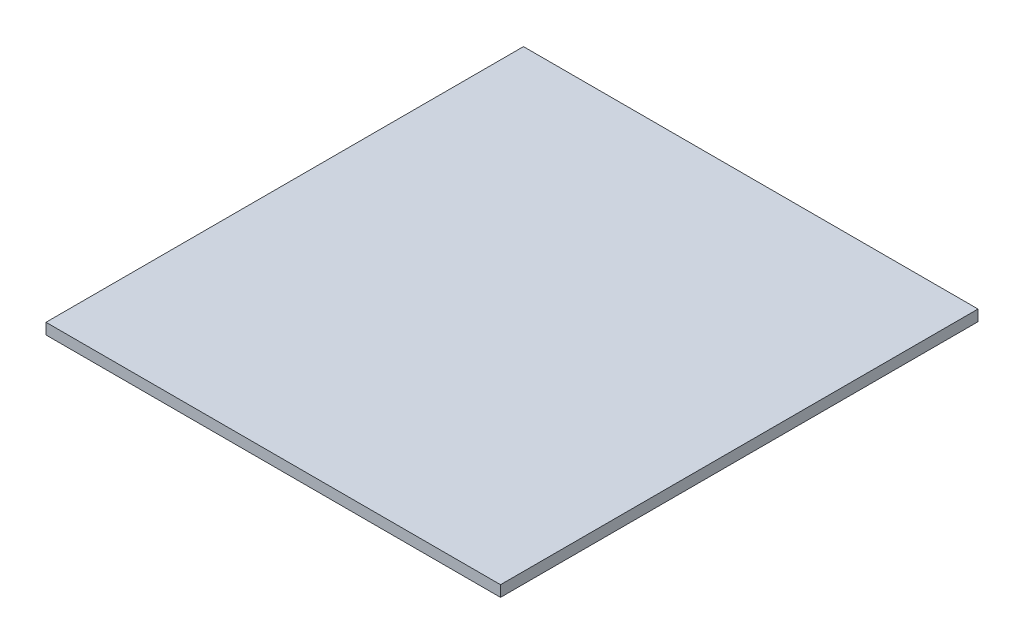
ISO-10303-21;
HEADER;
FILE_DESCRIPTION(('STEP AP214'),'2;1');
FILE_NAME('part.step','',(''),(''),'','','');
FILE_SCHEMA(('AUTOMOTIVE_DESIGN { 1 0 10303 214 1 1 1 1 }'));
ENDSEC;
DATA;
#1=APPLICATION_CONTEXT('core data for automotive mechanical design processes');
#2=APPLICATION_PROTOCOL_DEFINITION('international standard','automotive_design',2000,#1);
#3=PRODUCT_CONTEXT('',#1,'mechanical');
#4=PRODUCT('Part','Part','',(#3));
#5=PRODUCT_RELATED_PRODUCT_CATEGORY('part','',(#4));
#6=PRODUCT_DEFINITION_FORMATION('','',#4);
#7=PRODUCT_DEFINITION_CONTEXT('part definition',#1,'design');
#8=PRODUCT_DEFINITION('design','',#6,#7);
#9=PRODUCT_DEFINITION_SHAPE('','',#8);
#10=(LENGTH_UNIT() NAMED_UNIT(*) SI_UNIT(.MILLI.,.METRE.));
#11=(NAMED_UNIT(*) PLANE_ANGLE_UNIT() SI_UNIT($,.RADIAN.));
#12=(NAMED_UNIT(*) SI_UNIT($,.STERADIAN.) SOLID_ANGLE_UNIT());
#13=UNCERTAINTY_MEASURE_WITH_UNIT(LENGTH_MEASURE(1.E-05),#10,'distance_accuracy_value','');
#14=(GEOMETRIC_REPRESENTATION_CONTEXT(3) GLOBAL_UNCERTAINTY_ASSIGNED_CONTEXT((#13)) GLOBAL_UNIT_ASSIGNED_CONTEXT((#10,
#11,#12)) REPRESENTATION_CONTEXT('',''));
#15=CARTESIAN_POINT('',(0.,0.,0.));
#16=DIRECTION('',(0.,0.,1.));
#17=DIRECTION('',(1.,0.,0.));
#18=AXIS2_PLACEMENT_3D('',#15,#16,#17);
#19=CARTESIAN_POINT('',(247.5,12.,260.));
#20=DIRECTION('',(-1.,0.,0.));
#21=DIRECTION('',(0.,0.,1.));
#22=AXIS2_PLACEMENT_3D('',#19,#20,#21);
#23=PLANE('',#22);
#24=DIRECTION('',(0.,0.,-1.));
#25=VECTOR('',#24,1.);
#26=CARTESIAN_POINT('',(247.5,0.,260.));
#27=LINE('',#26,#25);
#28=CARTESIAN_POINT('',(247.5,0.,260.));
#29=VERTEX_POINT('',#28);
#30=CARTESIAN_POINT('',(247.5,0.,-260.));
#31=VERTEX_POINT('',#30);
#32=EDGE_CURVE('E98',#29,#31,#27,.T.);
#33=ORIENTED_EDGE('',*,*,#32,.T.);
#34=DIRECTION('',(0.,-1.,0.));
#35=VECTOR('',#34,1.);
#36=CARTESIAN_POINT('',(247.5,12.,-260.));
#37=LINE('',#36,#35);
#38=CARTESIAN_POINT('',(247.5,12.,-260.));
#39=VERTEX_POINT('',#38);
#40=EDGE_CURVE('E11',#39,#31,#37,.T.);
#41=ORIENTED_EDGE('',*,*,#40,.F.);
#42=DIRECTION('',(0.,0.,-1.));
#43=VECTOR('',#42,1.);
#44=CARTESIAN_POINT('',(247.5,12.,260.));
#45=LINE('',#44,#43);
#46=CARTESIAN_POINT('',(247.5,12.,260.));
#47=VERTEX_POINT('',#46);
#48=EDGE_CURVE('E86',#47,#39,#45,.T.);
#49=ORIENTED_EDGE('',*,*,#48,.F.);
#50=DIRECTION('',(0.,-1.,0.));
#51=VECTOR('',#50,1.);
#52=CARTESIAN_POINT('',(247.5,12.,260.));
#53=LINE('',#52,#51);
#54=EDGE_CURVE('E94',#47,#29,#53,.T.);
#55=ORIENTED_EDGE('',*,*,#54,.T.);
#56=EDGE_LOOP('',(#33,#41,#49,#55));
#57=FACE_BOUND('',#56,.T.);
#58=ADVANCED_FACE('F35',(#57),#23,.F.);
#59=CARTESIAN_POINT('',(-247.5,12.,-260.));
#60=DIRECTION('',(0.,0.,1.));
#61=DIRECTION('',(1.,0.,0.));
#62=AXIS2_PLACEMENT_3D('',#59,#60,#61);
#63=PLANE('',#62);
#64=DIRECTION('',(-1.,0.,0.));
#65=VECTOR('',#64,1.);
#66=CARTESIAN_POINT('',(-247.5,0.,-260.));
#67=LINE('',#66,#65);
#68=CARTESIAN_POINT('',(-247.5,0.,-260.));
#69=VERTEX_POINT('',#68);
#70=EDGE_CURVE('E90',#31,#69,#67,.T.);
#71=ORIENTED_EDGE('',*,*,#70,.T.);
#72=DIRECTION('',(0.,-1.,0.));
#73=VECTOR('',#72,1.);
#74=CARTESIAN_POINT('',(-247.5,12.,-260.));
#75=LINE('',#74,#73);
#76=CARTESIAN_POINT('',(-247.5,12.,-260.));
#77=VERTEX_POINT('',#76);
#78=EDGE_CURVE('E43',#77,#69,#75,.T.);
#79=ORIENTED_EDGE('',*,*,#78,.F.);
#80=DIRECTION('',(-1.,0.,0.));
#81=VECTOR('',#80,1.);
#82=CARTESIAN_POINT('',(-247.5,12.,-260.));
#83=LINE('',#82,#81);
#84=EDGE_CURVE('E81',#39,#77,#83,.T.);
#85=ORIENTED_EDGE('',*,*,#84,.F.);
#86=ORIENTED_EDGE('',*,*,#40,.T.);
#87=EDGE_LOOP('',(#71,#79,#85,#86));
#88=FACE_BOUND('',#87,.T.);
#89=ADVANCED_FACE('F89',(#88),#63,.F.);
#90=CARTESIAN_POINT('',(-247.5,12.,260.));
#91=DIRECTION('',(1.,0.,0.));
#92=DIRECTION('',(0.,0.,-1.));
#93=AXIS2_PLACEMENT_3D('',#90,#91,#92);
#94=PLANE('',#93);
#95=DIRECTION('',(0.,0.,1.));
#96=VECTOR('',#95,1.);
#97=CARTESIAN_POINT('',(-247.5,0.,260.));
#98=LINE('',#97,#96);
#99=CARTESIAN_POINT('',(-247.5,0.,260.));
#100=VERTEX_POINT('',#99);
#101=EDGE_CURVE('E68',#69,#100,#98,.T.);
#102=ORIENTED_EDGE('',*,*,#101,.T.);
#103=DIRECTION('',(0.,-1.,0.));
#104=VECTOR('',#103,1.);
#105=CARTESIAN_POINT('',(-247.5,12.,260.));
#106=LINE('',#105,#104);
#107=CARTESIAN_POINT('',(-247.5,12.,260.));
#108=VERTEX_POINT('',#107);
#109=EDGE_CURVE('E91',#108,#100,#106,.T.);
#110=ORIENTED_EDGE('',*,*,#109,.F.);
#111=DIRECTION('',(0.,0.,1.));
#112=VECTOR('',#111,1.);
#113=CARTESIAN_POINT('',(-247.5,12.,260.));
#114=LINE('',#113,#112);
#115=EDGE_CURVE('E84',#77,#108,#114,.T.);
#116=ORIENTED_EDGE('',*,*,#115,.F.);
#117=ORIENTED_EDGE('',*,*,#78,.T.);
#118=EDGE_LOOP('',(#102,#110,#116,#117));
#119=FACE_BOUND('',#118,.T.);
#120=ADVANCED_FACE('F92',(#119),#94,.F.);
#121=CARTESIAN_POINT('',(-247.5,12.,260.));
#122=DIRECTION('',(0.,0.,-1.));
#123=DIRECTION('',(-1.,0.,0.));
#124=AXIS2_PLACEMENT_3D('',#121,#122,#123);
#125=PLANE('',#124);
#126=DIRECTION('',(1.,0.,0.));
#127=VECTOR('',#126,1.);
#128=CARTESIAN_POINT('',(-247.5,0.,260.));
#129=LINE('',#128,#127);
#130=EDGE_CURVE('E74',#100,#29,#129,.T.);
#131=ORIENTED_EDGE('',*,*,#130,.T.);
#132=ORIENTED_EDGE('',*,*,#54,.F.);
#133=DIRECTION('',(1.,0.,0.));
#134=VECTOR('',#133,1.);
#135=CARTESIAN_POINT('',(-247.5,12.,260.));
#136=LINE('',#135,#134);
#137=EDGE_CURVE('E51',#108,#47,#136,.T.);
#138=ORIENTED_EDGE('',*,*,#137,.F.);
#139=ORIENTED_EDGE('',*,*,#109,.T.);
#140=EDGE_LOOP('',(#131,#132,#138,#139));
#141=FACE_BOUND('',#140,.T.);
#142=ADVANCED_FACE('F105',(#141),#125,.F.);
#143=CARTESIAN_POINT('',(0.,12.,0.));
#144=DIRECTION('',(0.,-1.,0.));
#145=DIRECTION('',(0.,0.,-1.));
#146=AXIS2_PLACEMENT_3D('',#143,#144,#145);
#147=PLANE('',#146);
#148=ORIENTED_EDGE('',*,*,#48,.T.);
#149=ORIENTED_EDGE('',*,*,#84,.T.);
#150=ORIENTED_EDGE('',*,*,#115,.T.);
#151=ORIENTED_EDGE('',*,*,#137,.T.);
#152=EDGE_LOOP('',(#148,#149,#150,#151));
#153=FACE_BOUND('',#152,.T.);
#154=ADVANCED_FACE('F82',(#153),#147,.F.);
#155=CARTESIAN_POINT('',(0.,0.,0.));
#156=DIRECTION('',(0.,-1.,0.));
#157=DIRECTION('',(0.,0.,-1.));
#158=AXIS2_PLACEMENT_3D('',#155,#156,#157);
#159=PLANE('',#158);
#160=ORIENTED_EDGE('',*,*,#32,.F.);
#161=ORIENTED_EDGE('',*,*,#130,.F.);
#162=ORIENTED_EDGE('',*,*,#101,.F.);
#163=ORIENTED_EDGE('',*,*,#70,.F.);
#164=EDGE_LOOP('',(#160,#161,#162,#163));
#165=FACE_BOUND('',#164,.T.);
#166=ADVANCED_FACE('F108',(#165),#159,.T.);
#167=CLOSED_SHELL('',(#58,#89,#120,#142,#154,#166));
#168=MANIFOLD_SOLID_BREP('B2',#167);
#169=ADVANCED_BREP_SHAPE_REPRESENTATION('',(#18,#168),#14);
#170=SHAPE_DEFINITION_REPRESENTATION(#9,#169);
ENDSEC;
END-ISO-10303-21;
